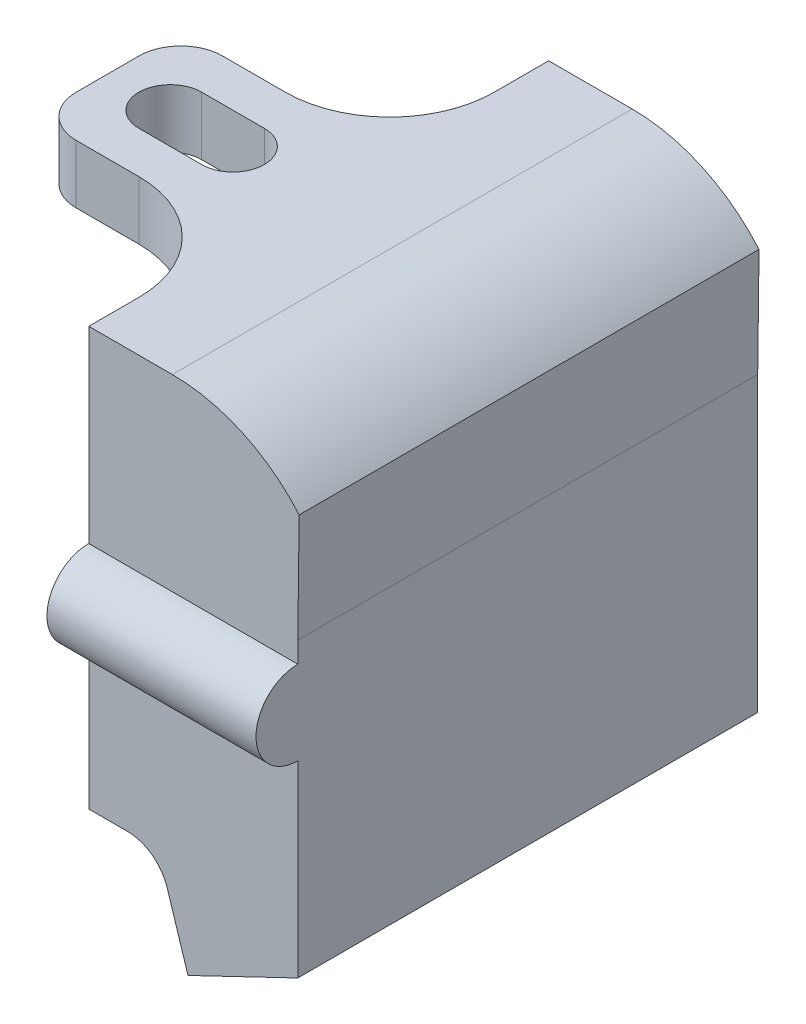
ISO-10303-21;
HEADER;
FILE_DESCRIPTION(('STEP AP214'),'2;1');
FILE_NAME('part.step','',(''),(''),'','','');
FILE_SCHEMA(('AUTOMOTIVE_DESIGN { 1 0 10303 214 1 1 1 1 }'));
ENDSEC;
DATA;
#1=APPLICATION_CONTEXT('core data for automotive mechanical design processes');
#2=APPLICATION_PROTOCOL_DEFINITION('international standard','automotive_design',2000,#1);
#3=PRODUCT_CONTEXT('',#1,'mechanical');
#4=PRODUCT('Part','Part','',(#3));
#5=PRODUCT_RELATED_PRODUCT_CATEGORY('part','',(#4));
#6=PRODUCT_DEFINITION_FORMATION('','',#4);
#7=PRODUCT_DEFINITION_CONTEXT('part definition',#1,'design');
#8=PRODUCT_DEFINITION('design','',#6,#7);
#9=PRODUCT_DEFINITION_SHAPE('','',#8);
#10=(LENGTH_UNIT() NAMED_UNIT(*) SI_UNIT(.MILLI.,.METRE.));
#11=(NAMED_UNIT(*) PLANE_ANGLE_UNIT() SI_UNIT($,.RADIAN.));
#12=(NAMED_UNIT(*) SI_UNIT($,.STERADIAN.) SOLID_ANGLE_UNIT());
#13=UNCERTAINTY_MEASURE_WITH_UNIT(LENGTH_MEASURE(1.E-05),#10,'distance_accuracy_value','');
#14=(GEOMETRIC_REPRESENTATION_CONTEXT(3) GLOBAL_UNCERTAINTY_ASSIGNED_CONTEXT((#13)) GLOBAL_UNIT_ASSIGNED_CONTEXT((#10,
#11,#12)) REPRESENTATION_CONTEXT('',''));
#15=CARTESIAN_POINT('',(0.,0.,0.));
#16=DIRECTION('',(0.,0.,1.));
#17=DIRECTION('',(1.,0.,0.));
#18=AXIS2_PLACEMENT_3D('',#15,#16,#17);
#19=CARTESIAN_POINT('',(31.8319433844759,9.00287861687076,1.));
#20=DIRECTION('',(0.,1.,0.));
#21=DIRECTION('',(-1.,0.,0.));
#22=AXIS2_PLACEMENT_3D('',#19,#20,#21);
#23=PLANE('',#22);
#24=DIRECTION('',(0.,0.,1.));
#25=VECTOR('',#24,1.);
#26=CARTESIAN_POINT('',(19.9412185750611,9.00287861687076,1.));
#27=LINE('',#26,#25);
#28=CARTESIAN_POINT('',(19.9412185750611,9.00287861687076,0.2));
#29=VERTEX_POINT('',#28);
#30=CARTESIAN_POINT('',(19.9412185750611,9.00287861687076,1.));
#31=VERTEX_POINT('',#30);
#32=EDGE_CURVE('E302',#29,#31,#27,.T.);
#33=ORIENTED_EDGE('',*,*,#32,.F.);
#34=DIRECTION('',(1.,0.,0.));
#35=VECTOR('',#34,1.);
#36=CARTESIAN_POINT('',(0.,9.00287861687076,0.2));
#37=LINE('',#36,#35);
#38=CARTESIAN_POINT('',(29.1412185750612,9.00287861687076,0.2));
#39=VERTEX_POINT('',#38);
#40=EDGE_CURVE('E260',#29,#39,#37,.T.);
#41=ORIENTED_EDGE('',*,*,#40,.T.);
#42=DIRECTION('',(0.,0.,1.));
#43=VECTOR('',#42,1.);
#44=CARTESIAN_POINT('',(29.1412185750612,9.00287861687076,1.));
#45=LINE('',#44,#43);
#46=CARTESIAN_POINT('',(29.1412185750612,9.00287861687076,1.));
#47=VERTEX_POINT('',#46);
#48=EDGE_CURVE('E264',#47,#39,#45,.F.);
#49=ORIENTED_EDGE('',*,*,#48,.F.);
#50=DIRECTION('',(-1.,0.,0.));
#51=VECTOR('',#50,1.);
#52=CARTESIAN_POINT('',(31.8319433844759,9.00287861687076,1.));
#53=LINE('',#52,#51);
#54=EDGE_CURVE('E276',#47,#31,#53,.T.);
#55=ORIENTED_EDGE('',*,*,#54,.T.);
#56=EDGE_LOOP('',(#33,#41,#49,#55));
#57=FACE_BOUND('',#56,.T.);
#58=ADVANCED_FACE('F17',(#57),#23,.F.);
#59=CARTESIAN_POINT('',(21.7887571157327,-2.99712138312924,-46.6422255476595));
#60=DIRECTION('',(0.,0.,-1.));
#61=DIRECTION('',(-1.,0.,0.));
#62=AXIS2_PLACEMENT_3D('',#59,#60,#61);
#63=CYLINDRICAL_SURFACE('',#62,2.8);
#64=CARTESIAN_POINT('',(21.7887571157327,-2.99712138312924,0.199999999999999));
#65=DIRECTION('',(0.,0.,-1.));
#66=DIRECTION('',(-1.,0.,0.));
#67=AXIS2_PLACEMENT_3D('',#64,#65,#66);
#68=CIRCLE('',#67,2.8);
#69=CARTESIAN_POINT('',(21.7887571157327,-0.19712138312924,0.199999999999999));
#70=VERTEX_POINT('',#69);
#71=CARTESIAN_POINT('',(24.4576759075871,-2.15043815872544,0.200000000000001));
#72=VERTEX_POINT('',#71);
#73=EDGE_CURVE('E414',#70,#72,#68,.T.);
#74=ORIENTED_EDGE('',*,*,#73,.T.);
#75=DIRECTION('',(0.,0.,1.));
#76=VECTOR('',#75,1.);
#77=CARTESIAN_POINT('',(24.4576759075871,-2.15043815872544,-46.6422255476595));
#78=LINE('',#77,#76);
#79=CARTESIAN_POINT('',(24.4576759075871,-2.15043815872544,-20.1999889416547));
#80=VERTEX_POINT('',#79);
#81=EDGE_CURVE('E310',#72,#80,#78,.F.);
#82=ORIENTED_EDGE('',*,*,#81,.T.);
#83=CARTESIAN_POINT('',(21.7887571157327,-2.99712138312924,-20.1999889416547));
#84=DIRECTION('',(0.,0.,-1.));
#85=DIRECTION('',(-1.,0.,0.));
#86=AXIS2_PLACEMENT_3D('',#83,#84,#85);
#87=CIRCLE('',#86,2.8);
#88=CARTESIAN_POINT('',(21.7887571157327,-0.19712138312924,-20.1999889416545));
#89=VERTEX_POINT('',#88);
#90=EDGE_CURVE('E419',#80,#89,#87,.F.);
#91=ORIENTED_EDGE('',*,*,#90,.T.);
#92=DIRECTION('',(0.,0.,-1.));
#93=VECTOR('',#92,1.);
#94=CARTESIAN_POINT('',(21.7887571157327,-0.19712138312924,-46.6422255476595));
#95=LINE('',#94,#93);
#96=EDGE_CURVE('E321',#89,#70,#95,.F.);
#97=ORIENTED_EDGE('',*,*,#96,.T.);
#98=EDGE_LOOP('',(#74,#82,#91,#97));
#99=FACE_BOUND('',#98,.T.);
#100=ADVANCED_FACE('F956',(#99),#63,.T.);
#101=CARTESIAN_POINT('',(31.8319433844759,7.00287861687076,1.));
#102=DIRECTION('',(0.,-1.,0.));
#103=DIRECTION('',(1.,0.,0.));
#104=AXIS2_PLACEMENT_3D('',#101,#102,#103);
#105=PLANE('',#104);
#106=DIRECTION('',(0.,0.,1.));
#107=VECTOR('',#106,1.);
#108=CARTESIAN_POINT('',(19.9412185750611,7.00287861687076,1.));
#109=LINE('',#108,#107);
#110=CARTESIAN_POINT('',(19.9412185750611,7.00287861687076,1.));
#111=VERTEX_POINT('',#110);
#112=CARTESIAN_POINT('',(19.9412185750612,7.00287861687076,0.2));
#113=VERTEX_POINT('',#112);
#114=EDGE_CURVE('E261',#111,#113,#109,.F.);
#115=ORIENTED_EDGE('',*,*,#114,.F.);
#116=DIRECTION('',(-1.,0.,0.));
#117=VECTOR('',#116,1.);
#118=CARTESIAN_POINT('',(31.8319433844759,7.00287861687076,1.));
#119=LINE('',#118,#117);
#120=CARTESIAN_POINT('',(29.1412185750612,7.00287861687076,1.));
#121=VERTEX_POINT('',#120);
#122=EDGE_CURVE('E323',#111,#121,#119,.F.);
#123=ORIENTED_EDGE('',*,*,#122,.T.);
#124=DIRECTION('',(0.,0.,1.));
#125=VECTOR('',#124,1.);
#126=CARTESIAN_POINT('',(29.1412185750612,7.00287861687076,1.));
#127=LINE('',#126,#125);
#128=CARTESIAN_POINT('',(29.1412185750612,7.00287861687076,0.199999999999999));
#129=VERTEX_POINT('',#128);
#130=EDGE_CURVE('E298',#129,#121,#127,.T.);
#131=ORIENTED_EDGE('',*,*,#130,.F.);
#132=DIRECTION('',(1.,0.,0.));
#133=VECTOR('',#132,1.);
#134=CARTESIAN_POINT('',(0.,7.00287861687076,0.2));
#135=LINE('',#134,#133);
#136=EDGE_CURVE('E280',#129,#113,#135,.F.);
#137=ORIENTED_EDGE('',*,*,#136,.T.);
#138=EDGE_LOOP('',(#115,#123,#131,#137));
#139=FACE_BOUND('',#138,.T.);
#140=ADVANCED_FACE('F496',(#139),#105,.F.);
#141=CARTESIAN_POINT('',(23.1412185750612,10.2028786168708,-46.6422255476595));
#142=DIRECTION('',(0.,0.,-1.));
#143=DIRECTION('',(-1.,0.,0.));
#144=AXIS2_PLACEMENT_3D('',#141,#142,#143);
#145=CYLINDRICAL_SURFACE('',#144,6.);
#146=DIRECTION('',(0.,0.,-1.));
#147=VECTOR('',#146,1.);
#148=CARTESIAN_POINT('',(29.1412185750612,10.2028786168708,-46.6422255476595));
#149=LINE('',#148,#147);
#150=CARTESIAN_POINT('',(29.1412185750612,10.2028786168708,-20.1999889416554));
#151=VERTEX_POINT('',#150);
#152=CARTESIAN_POINT('',(29.1412185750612,10.2028786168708,0.199999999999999));
#153=VERTEX_POINT('',#152);
#154=EDGE_CURVE('E240',#151,#153,#149,.F.);
#155=ORIENTED_EDGE('',*,*,#154,.T.);
#156=CARTESIAN_POINT('',(23.1412185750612,10.2028786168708,0.199999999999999));
#157=DIRECTION('',(0.,0.,-1.));
#158=DIRECTION('',(-1.,0.,0.));
#159=AXIS2_PLACEMENT_3D('',#156,#157,#158);
#160=CIRCLE('',#159,6.);
#161=CARTESIAN_POINT('',(23.1412185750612,16.2028786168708,0.199999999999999));
#162=VERTEX_POINT('',#161);
#163=EDGE_CURVE('E20',#153,#162,#160,.F.);
#164=ORIENTED_EDGE('',*,*,#163,.T.);
#165=DIRECTION('',(0.,0.,1.));
#166=VECTOR('',#165,1.);
#167=CARTESIAN_POINT('',(23.1412185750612,16.2028786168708,-46.6422255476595));
#168=LINE('',#167,#166);
#169=CARTESIAN_POINT('',(23.1412185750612,16.2028786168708,-20.199988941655));
#170=VERTEX_POINT('',#169);
#171=EDGE_CURVE('E328',#162,#170,#168,.F.);
#172=ORIENTED_EDGE('',*,*,#171,.T.);
#173=CARTESIAN_POINT('',(23.1412185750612,10.2028786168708,-20.1999889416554));
#174=DIRECTION('',(0.,0.,-1.));
#175=DIRECTION('',(-1.,0.,0.));
#176=AXIS2_PLACEMENT_3D('',#173,#174,#175);
#177=CIRCLE('',#176,6.);
#178=EDGE_CURVE('E245',#170,#151,#177,.T.);
#179=ORIENTED_EDGE('',*,*,#178,.T.);
#180=EDGE_LOOP('',(#155,#164,#172,#179));
#181=FACE_BOUND('',#180,.T.);
#182=ADVANCED_FACE('F242',(#181),#145,.F.);
#183=CARTESIAN_POINT('',(0.,0.,0.2));
#184=DIRECTION('',(0.,0.,1.));
#185=DIRECTION('',(1.,0.,0.));
#186=AXIS2_PLACEMENT_3D('',#183,#184,#185);
#187=PLANE('',#186);
#188=ORIENTED_EDGE('',*,*,#40,.F.);
#189=DIRECTION('',(0.,-1.,0.));
#190=VECTOR('',#189,1.);
#191=CARTESIAN_POINT('',(19.9412185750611,17.0028786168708,0.199999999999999));
#192=LINE('',#191,#190);
#193=CARTESIAN_POINT('',(19.9412185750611,16.2028786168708,0.199999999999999));
#194=VERTEX_POINT('',#193);
#195=EDGE_CURVE('E412',#194,#29,#192,.T.);
#196=ORIENTED_EDGE('',*,*,#195,.F.);
#197=DIRECTION('',(-1.,0.,0.));
#198=VECTOR('',#197,1.);
#199=CARTESIAN_POINT('',(29.9412185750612,16.2028786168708,0.199999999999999));
#200=LINE('',#199,#198);
#201=EDGE_CURVE('E258',#194,#162,#200,.F.);
#202=ORIENTED_EDGE('',*,*,#201,.T.);
#203=ORIENTED_EDGE('',*,*,#163,.F.);
#204=DIRECTION('',(0.,1.,0.));
#205=VECTOR('',#204,1.);
#206=CARTESIAN_POINT('',(29.1412185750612,-2.99712138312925,0.199999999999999));
#207=LINE('',#206,#205);
#208=EDGE_CURVE('E250',#153,#39,#207,.F.);
#209=ORIENTED_EDGE('',*,*,#208,.T.);
#210=EDGE_LOOP('',(#188,#196,#202,#203,#209));
#211=FACE_BOUND('',#210,.T.);
#212=ADVANCED_FACE('F256',(#211),#187,.F.);
#213=CARTESIAN_POINT('',(31.8319433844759,8.00287861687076,1.));
#214=DIRECTION('',(-1.,0.,0.));
#215=DIRECTION('',(0.,-1.,0.));
#216=AXIS2_PLACEMENT_3D('',#213,#214,#215);
#217=CYLINDRICAL_SURFACE('',#216,1.);
#218=CARTESIAN_POINT('',(19.9412185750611,8.00287861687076,1.));
#219=DIRECTION('',(-1.,0.,0.));
#220=DIRECTION('',(0.,-1.,0.));
#221=AXIS2_PLACEMENT_3D('',#218,#219,#220);
#222=CIRCLE('',#221,1.);
#223=EDGE_CURVE('E409',#31,#111,#222,.F.);
#224=ORIENTED_EDGE('',*,*,#223,.F.);
#225=ORIENTED_EDGE('',*,*,#54,.F.);
#226=CARTESIAN_POINT('',(29.1412185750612,8.00287861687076,1.));
#227=DIRECTION('',(-1.,0.,0.));
#228=DIRECTION('',(0.,-1.,0.));
#229=AXIS2_PLACEMENT_3D('',#226,#227,#228);
#230=CIRCLE('',#229,1.);
#231=EDGE_CURVE('E266',#47,#121,#230,.F.);
#232=ORIENTED_EDGE('',*,*,#231,.T.);
#233=ORIENTED_EDGE('',*,*,#122,.F.);
#234=EDGE_LOOP('',(#224,#225,#232,#233));
#235=FACE_BOUND('',#234,.T.);
#236=ADVANCED_FACE('F492',(#235),#217,.F.);
#237=CARTESIAN_POINT('',(19.9412185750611,-0.19712138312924,-46.6422255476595));
#238=DIRECTION('',(0.,-1.,0.));
#239=DIRECTION('',(0.,0.,-1.));
#240=AXIS2_PLACEMENT_3D('',#237,#238,#239);
#241=PLANE('',#240);
#242=DIRECTION('',(0.,0.,1.));
#243=VECTOR('',#242,1.);
#244=CARTESIAN_POINT('',(19.9412185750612,-0.197121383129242,-46.6422255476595));
#245=LINE('',#244,#243);
#246=CARTESIAN_POINT('',(19.9412185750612,-0.197121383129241,0.199999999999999));
#247=VERTEX_POINT('',#246);
#248=CARTESIAN_POINT('',(19.9412185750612,-0.197121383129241,-20.1999889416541));
#249=VERTEX_POINT('',#248);
#250=EDGE_CURVE('E453',#247,#249,#245,.F.);
#251=ORIENTED_EDGE('',*,*,#250,.F.);
#252=DIRECTION('',(1.,0.,0.));
#253=VECTOR('',#252,1.);
#254=CARTESIAN_POINT('',(0.,-0.19712138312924,0.2));
#255=LINE('',#254,#253);
#256=EDGE_CURVE('E325',#247,#70,#255,.T.);
#257=ORIENTED_EDGE('',*,*,#256,.T.);
#258=ORIENTED_EDGE('',*,*,#96,.F.);
#259=DIRECTION('',(-1.,0.,1.4611402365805E-13));
#260=VECTOR('',#259,1.);
#261=CARTESIAN_POINT('',(22.3853694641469,-0.19712138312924,-20.1999889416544));
#262=LINE('',#261,#260);
#263=EDGE_CURVE('E421',#89,#249,#262,.T.);
#264=ORIENTED_EDGE('',*,*,#263,.T.);
#265=EDGE_LOOP('',(#251,#257,#258,#264));
#266=FACE_BOUND('',#265,.T.);
#267=ADVANCED_FACE('F507',(#266),#241,.F.);
#268=CARTESIAN_POINT('',(29.9412185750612,16.2028786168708,-46.6422255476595));
#269=DIRECTION('',(0.,1.,0.));
#270=DIRECTION('',(-1.,0.,0.));
#271=AXIS2_PLACEMENT_3D('',#268,#269,#270);
#272=PLANE('',#271);
#273=CARTESIAN_POINT('',(11.9412185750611,16.2028786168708,-8.39998894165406));
#274=DIRECTION('',(0.,-1.,0.));
#275=DIRECTION('',(0.,0.,-1.));
#276=AXIS2_PLACEMENT_3D('',#273,#274,#275);
#277=CIRCLE('',#276,2.);
#278=CARTESIAN_POINT('',(9.94121857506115,16.2028786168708,-8.39998894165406));
#279=VERTEX_POINT('',#278);
#280=CARTESIAN_POINT('',(11.9412185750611,16.2028786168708,-6.39998894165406));
#281=VERTEX_POINT('',#280);
#282=EDGE_CURVE('E341',#279,#281,#277,.F.);
#283=ORIENTED_EDGE('',*,*,#282,.F.);
#284=DIRECTION('',(0.,0.,1.));
#285=VECTOR('',#284,1.);
#286=CARTESIAN_POINT('',(9.94121857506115,16.2028786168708,0.));
#287=LINE('',#286,#285);
#288=CARTESIAN_POINT('',(9.94121857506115,16.2028786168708,-11.3999889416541));
#289=VERTEX_POINT('',#288);
#290=EDGE_CURVE('E330',#289,#279,#287,.T.);
#291=ORIENTED_EDGE('',*,*,#290,.F.);
#292=CARTESIAN_POINT('',(11.9412185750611,16.2028786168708,-11.3999889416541));
#293=DIRECTION('',(0.,1.,0.));
#294=DIRECTION('',(0.,0.,1.));
#295=AXIS2_PLACEMENT_3D('',#292,#293,#294);
#296=CIRCLE('',#295,2.);
#297=CARTESIAN_POINT('',(11.9412185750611,16.2028786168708,-13.3999889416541));
#298=VERTEX_POINT('',#297);
#299=EDGE_CURVE('E427',#298,#289,#296,.T.);
#300=ORIENTED_EDGE('',*,*,#299,.F.);
#301=DIRECTION('',(1.,0.,0.));
#302=VECTOR('',#301,1.);
#303=CARTESIAN_POINT('',(9.94121857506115,16.2028786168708,-13.3999889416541));
#304=LINE('',#303,#302);
#305=CARTESIAN_POINT('',(14.9412185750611,16.2028786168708,-13.3999889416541));
#306=VERTEX_POINT('',#305);
#307=EDGE_CURVE('E342',#298,#306,#304,.T.);
#308=ORIENTED_EDGE('',*,*,#307,.T.);
#309=CARTESIAN_POINT('',(14.9412185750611,16.2028786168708,-18.3999889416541));
#310=DIRECTION('',(0.,-1.,0.));
#311=DIRECTION('',(1.,0.,0.));
#312=AXIS2_PLACEMENT_3D('',#309,#310,#311);
#313=CIRCLE('',#312,5.);
#314=CARTESIAN_POINT('',(19.9412185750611,16.2028786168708,-18.3999889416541));
#315=VERTEX_POINT('',#314);
#316=EDGE_CURVE('E430',#306,#315,#313,.F.);
#317=ORIENTED_EDGE('',*,*,#316,.T.);
#318=DIRECTION('',(0.,0.,1.));
#319=VECTOR('',#318,1.);
#320=CARTESIAN_POINT('',(19.9412185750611,16.2028786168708,-46.6422255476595));
#321=LINE('',#320,#319);
#322=CARTESIAN_POINT('',(19.9412185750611,16.2028786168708,-20.1999889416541));
#323=VERTEX_POINT('',#322);
#324=EDGE_CURVE('E444',#323,#315,#321,.T.);
#325=ORIENTED_EDGE('',*,*,#324,.F.);
#326=DIRECTION('',(-1.,0.,1.4611402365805E-13));
#327=VECTOR('',#326,1.);
#328=CARTESIAN_POINT('',(22.3853694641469,16.2028786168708,-20.1999889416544));
#329=LINE('',#328,#327);
#330=EDGE_CURVE('E418',#323,#170,#329,.F.);
#331=ORIENTED_EDGE('',*,*,#330,.T.);
#332=ORIENTED_EDGE('',*,*,#171,.F.);
#333=ORIENTED_EDGE('',*,*,#201,.F.);
#334=DIRECTION('',(0.,0.,1.));
#335=VECTOR('',#334,1.);
#336=CARTESIAN_POINT('',(19.9412185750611,16.2028786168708,-46.6422255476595));
#337=LINE('',#336,#335);
#338=CARTESIAN_POINT('',(19.9412185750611,16.2028786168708,-1.39998894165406));
#339=VERTEX_POINT('',#338);
#340=EDGE_CURVE('E472',#339,#194,#337,.T.);
#341=ORIENTED_EDGE('',*,*,#340,.F.);
#342=CARTESIAN_POINT('',(14.9412185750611,16.2028786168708,-1.39998894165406));
#343=DIRECTION('',(0.,1.,0.));
#344=DIRECTION('',(0.,0.,1.));
#345=AXIS2_PLACEMENT_3D('',#342,#343,#344);
#346=CIRCLE('',#345,5.);
#347=CARTESIAN_POINT('',(14.9412185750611,16.2028786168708,-6.39998894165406));
#348=VERTEX_POINT('',#347);
#349=EDGE_CURVE('E432',#339,#348,#346,.T.);
#350=ORIENTED_EDGE('',*,*,#349,.T.);
#351=DIRECTION('',(1.,0.,0.));
#352=VECTOR('',#351,1.);
#353=CARTESIAN_POINT('',(9.94121857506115,16.2028786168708,-6.39998894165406));
#354=LINE('',#353,#352);
#355=EDGE_CURVE('E347',#348,#281,#354,.F.);
#356=ORIENTED_EDGE('',*,*,#355,.T.);
#357=EDGE_LOOP('',(#283,#291,#300,#308,#317,#325,#331,#332,#333,#341,#350,#356));
#358=FACE_BOUND('',#357,.T.);
#359=CARTESIAN_POINT('',(12.9412185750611,16.2028786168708,-9.89998894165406));
#360=DIRECTION('',(0.,1.,0.));
#361=DIRECTION('',(-1.,0.,0.));
#362=AXIS2_PLACEMENT_3D('',#359,#360,#361);
#363=CIRCLE('',#362,1.5);
#364=CARTESIAN_POINT('',(12.9412185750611,16.2028786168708,-11.3999889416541));
#365=VERTEX_POINT('',#364);
#366=CARTESIAN_POINT('',(12.9412185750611,16.2028786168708,-8.39998894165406));
#367=VERTEX_POINT('',#366);
#368=EDGE_CURVE('E334',#365,#367,#363,.T.);
#369=ORIENTED_EDGE('',*,*,#368,.T.);
#370=DIRECTION('',(1.,0.,0.));
#371=VECTOR('',#370,1.);
#372=CARTESIAN_POINT('',(12.9412185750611,16.2028786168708,-8.39998894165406));
#373=LINE('',#372,#371);
#374=CARTESIAN_POINT('',(15.9412185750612,16.2028786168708,-8.39998894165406));
#375=VERTEX_POINT('',#374);
#376=EDGE_CURVE('E335',#367,#375,#373,.T.);
#377=ORIENTED_EDGE('',*,*,#376,.T.);
#378=CARTESIAN_POINT('',(15.9412185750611,16.2028786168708,-9.89998894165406));
#379=DIRECTION('',(0.,1.,0.));
#380=DIRECTION('',(-1.,0.,0.));
#381=AXIS2_PLACEMENT_3D('',#378,#379,#380);
#382=CIRCLE('',#381,1.5);
#383=CARTESIAN_POINT('',(15.9412185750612,16.2028786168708,-11.3999889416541));
#384=VERTEX_POINT('',#383);
#385=EDGE_CURVE('E338',#375,#384,#382,.T.);
#386=ORIENTED_EDGE('',*,*,#385,.T.);
#387=DIRECTION('',(-1.,0.,0.));
#388=VECTOR('',#387,1.);
#389=CARTESIAN_POINT('',(12.9412185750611,16.2028786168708,-11.3999889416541));
#390=LINE('',#389,#388);
#391=EDGE_CURVE('E331',#384,#365,#390,.T.);
#392=ORIENTED_EDGE('',*,*,#391,.T.);
#393=EDGE_LOOP('',(#369,#377,#386,#392));
#394=FACE_BOUND('',#393,.T.);
#395=ADVANCED_FACE('F517',(#358,#394),#272,.F.);
#396=CARTESIAN_POINT('',(9.94121857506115,0.,0.));
#397=DIRECTION('',(-1.,0.,0.));
#398=DIRECTION('',(0.,0.,1.));
#399=AXIS2_PLACEMENT_3D('',#396,#397,#398);
#400=PLANE('',#399);
#401=DIRECTION('',(0.,0.,1.));
#402=VECTOR('',#401,1.);
#403=CARTESIAN_POINT('',(9.94121857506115,19.0028786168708,-33.8563701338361));
#404=LINE('',#403,#402);
#405=CARTESIAN_POINT('',(9.94121857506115,19.0028786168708,-11.3999889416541));
#406=VERTEX_POINT('',#405);
#407=CARTESIAN_POINT('',(9.94121857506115,19.0028786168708,-8.39998894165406));
#408=VERTEX_POINT('',#407);
#409=EDGE_CURVE('E408',#406,#408,#404,.T.);
#410=ORIENTED_EDGE('',*,*,#409,.F.);
#411=DIRECTION('',(0.,1.,0.));
#412=VECTOR('',#411,1.);
#413=CARTESIAN_POINT('',(9.94121857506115,0.,-11.3999889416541));
#414=LINE('',#413,#412);
#415=EDGE_CURVE('E426',#289,#406,#414,.T.);
#416=ORIENTED_EDGE('',*,*,#415,.F.);
#417=ORIENTED_EDGE('',*,*,#290,.T.);
#418=DIRECTION('',(0.,-1.,0.));
#419=VECTOR('',#418,1.);
#420=CARTESIAN_POINT('',(9.94121857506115,0.,-8.39998894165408));
#421=LINE('',#420,#419);
#422=EDGE_CURVE('E350',#408,#279,#421,.T.);
#423=ORIENTED_EDGE('',*,*,#422,.F.);
#424=EDGE_LOOP('',(#410,#416,#417,#423));
#425=FACE_BOUND('',#424,.T.);
#426=ADVANCED_FACE('F547',(#425),#400,.T.);
#427=CARTESIAN_POINT('',(11.9412185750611,0.,-8.39998894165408));
#428=DIRECTION('',(0.,-1.,0.));
#429=DIRECTION('',(0.,0.,-1.));
#430=AXIS2_PLACEMENT_3D('',#427,#428,#429);
#431=CYLINDRICAL_SURFACE('',#430,2.);
#432=CARTESIAN_POINT('',(11.9412185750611,19.0028786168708,-8.39998894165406));
#433=DIRECTION('',(0.,-1.,0.));
#434=DIRECTION('',(0.,0.,-1.));
#435=AXIS2_PLACEMENT_3D('',#432,#433,#434);
#436=CIRCLE('',#435,2.);
#437=CARTESIAN_POINT('',(11.9412185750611,19.0028786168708,-6.39998894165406));
#438=VERTEX_POINT('',#437);
#439=EDGE_CURVE('E405',#408,#438,#436,.F.);
#440=ORIENTED_EDGE('',*,*,#439,.F.);
#441=ORIENTED_EDGE('',*,*,#422,.T.);
#442=ORIENTED_EDGE('',*,*,#282,.T.);
#443=DIRECTION('',(0.,1.,0.));
#444=VECTOR('',#443,1.);
#445=CARTESIAN_POINT('',(11.9412185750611,16.2028786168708,-6.39998894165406));
#446=LINE('',#445,#444);
#447=EDGE_CURVE('E349',#281,#438,#446,.T.);
#448=ORIENTED_EDGE('',*,*,#447,.T.);
#449=EDGE_LOOP('',(#440,#441,#442,#448));
#450=FACE_BOUND('',#449,.T.);
#451=ADVANCED_FACE('F536',(#450),#431,.T.);
#452=CARTESIAN_POINT('',(9.94121857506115,16.2028786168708,-6.39998894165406));
#453=DIRECTION('',(0.,0.,-1.));
#454=DIRECTION('',(0.,1.,0.));
#455=AXIS2_PLACEMENT_3D('',#452,#453,#454);
#456=PLANE('',#455);
#457=ORIENTED_EDGE('',*,*,#447,.F.);
#458=ORIENTED_EDGE('',*,*,#355,.F.);
#459=DIRECTION('',(0.,1.,0.));
#460=VECTOR('',#459,1.);
#461=CARTESIAN_POINT('',(14.9412185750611,16.2028786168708,-6.39998894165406));
#462=LINE('',#461,#460);
#463=CARTESIAN_POINT('',(14.9412185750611,19.0028786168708,-6.39998894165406));
#464=VERTEX_POINT('',#463);
#465=EDGE_CURVE('E434',#348,#464,#462,.T.);
#466=ORIENTED_EDGE('',*,*,#465,.T.);
#467=DIRECTION('',(1.,0.,0.));
#468=VECTOR('',#467,1.);
#469=CARTESIAN_POINT('',(23.9412185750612,19.0028786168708,-6.39998894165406));
#470=LINE('',#469,#468);
#471=EDGE_CURVE('E404',#438,#464,#470,.T.);
#472=ORIENTED_EDGE('',*,*,#471,.F.);
#473=EDGE_LOOP('',(#457,#458,#466,#472));
#474=FACE_BOUND('',#473,.T.);
#475=ADVANCED_FACE('F538',(#474),#456,.F.);
#476=CARTESIAN_POINT('',(14.9412185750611,16.2028786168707,-1.39998894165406));
#477=DIRECTION('',(0.,1.,0.));
#478=DIRECTION('',(0.,0.,1.));
#479=AXIS2_PLACEMENT_3D('',#476,#477,#478);
#480=CYLINDRICAL_SURFACE('',#479,5.);
#481=DIRECTION('',(0.,-1.,0.));
#482=VECTOR('',#481,1.);
#483=CARTESIAN_POINT('',(19.9412185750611,17.0028786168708,-1.39998894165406));
#484=LINE('',#483,#482);
#485=CARTESIAN_POINT('',(19.9412185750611,19.0028786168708,-1.39998894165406));
#486=VERTEX_POINT('',#485);
#487=EDGE_CURVE('E307',#486,#339,#484,.T.);
#488=ORIENTED_EDGE('',*,*,#487,.F.);
#489=CARTESIAN_POINT('',(14.9412185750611,19.0028786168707,-1.39998894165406));
#490=DIRECTION('',(0.,1.,0.));
#491=DIRECTION('',(0.,0.,1.));
#492=AXIS2_PLACEMENT_3D('',#489,#490,#491);
#493=CIRCLE('',#492,5.);
#494=EDGE_CURVE('E400',#464,#486,#493,.F.);
#495=ORIENTED_EDGE('',*,*,#494,.F.);
#496=ORIENTED_EDGE('',*,*,#465,.F.);
#497=ORIENTED_EDGE('',*,*,#349,.F.);
#498=EDGE_LOOP('',(#488,#495,#496,#497));
#499=FACE_BOUND('',#498,.T.);
#500=ADVANCED_FACE('F558',(#499),#480,.F.);
#501=CARTESIAN_POINT('',(14.9412185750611,16.2028786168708,-18.3999889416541));
#502=DIRECTION('',(0.,-1.,0.));
#503=DIRECTION('',(1.,0.,0.));
#504=AXIS2_PLACEMENT_3D('',#501,#502,#503);
#505=CYLINDRICAL_SURFACE('',#504,5.);
#506=DIRECTION('',(0.,-1.,0.));
#507=VECTOR('',#506,1.);
#508=CARTESIAN_POINT('',(19.9412185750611,17.0028786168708,-18.3999889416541));
#509=LINE('',#508,#507);
#510=CARTESIAN_POINT('',(19.9412185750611,19.0028786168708,-18.3999889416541));
#511=VERTEX_POINT('',#510);
#512=EDGE_CURVE('E447',#315,#511,#509,.F.);
#513=ORIENTED_EDGE('',*,*,#512,.F.);
#514=ORIENTED_EDGE('',*,*,#316,.F.);
#515=DIRECTION('',(0.,1.,0.));
#516=VECTOR('',#515,1.);
#517=CARTESIAN_POINT('',(14.9412185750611,16.2028786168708,-13.3999889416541));
#518=LINE('',#517,#516);
#519=CARTESIAN_POINT('',(14.9412185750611,19.0028786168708,-13.3999889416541));
#520=VERTEX_POINT('',#519);
#521=EDGE_CURVE('E346',#306,#520,#518,.T.);
#522=ORIENTED_EDGE('',*,*,#521,.T.);
#523=CARTESIAN_POINT('',(14.9412185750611,19.0028786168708,-18.3999889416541));
#524=DIRECTION('',(0.,-1.,0.));
#525=DIRECTION('',(1.,0.,0.));
#526=AXIS2_PLACEMENT_3D('',#523,#524,#525);
#527=CIRCLE('',#526,5.);
#528=EDGE_CURVE('E396',#511,#520,#527,.T.);
#529=ORIENTED_EDGE('',*,*,#528,.F.);
#530=EDGE_LOOP('',(#513,#514,#522,#529));
#531=FACE_BOUND('',#530,.T.);
#532=ADVANCED_FACE('F524',(#531),#505,.F.);
#533=CARTESIAN_POINT('',(9.94121857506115,16.2028786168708,-13.3999889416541));
#534=DIRECTION('',(0.,0.,1.));
#535=DIRECTION('',(1.,0.,0.));
#536=AXIS2_PLACEMENT_3D('',#533,#534,#535);
#537=PLANE('',#536);
#538=DIRECTION('',(0.,1.,0.));
#539=VECTOR('',#538,1.);
#540=CARTESIAN_POINT('',(11.9412185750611,0.,-13.3999889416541));
#541=LINE('',#540,#539);
#542=CARTESIAN_POINT('',(11.9412185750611,19.0028786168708,-13.3999889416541));
#543=VERTEX_POINT('',#542);
#544=EDGE_CURVE('E345',#543,#298,#541,.F.);
#545=ORIENTED_EDGE('',*,*,#544,.F.);
#546=DIRECTION('',(1.,0.,0.));
#547=VECTOR('',#546,1.);
#548=CARTESIAN_POINT('',(23.9412185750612,19.0028786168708,-13.3999889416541));
#549=LINE('',#548,#547);
#550=EDGE_CURVE('E395',#520,#543,#549,.F.);
#551=ORIENTED_EDGE('',*,*,#550,.F.);
#552=ORIENTED_EDGE('',*,*,#521,.F.);
#553=ORIENTED_EDGE('',*,*,#307,.F.);
#554=EDGE_LOOP('',(#545,#551,#552,#553));
#555=FACE_BOUND('',#554,.T.);
#556=ADVANCED_FACE('F556',(#555),#537,.F.);
#557=CARTESIAN_POINT('',(11.9412185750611,0.,-11.3999889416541));
#558=DIRECTION('',(0.,1.,0.));
#559=DIRECTION('',(0.,0.,1.));
#560=AXIS2_PLACEMENT_3D('',#557,#558,#559);
#561=CYLINDRICAL_SURFACE('',#560,2.);
#562=ORIENTED_EDGE('',*,*,#299,.T.);
#563=ORIENTED_EDGE('',*,*,#415,.T.);
#564=CARTESIAN_POINT('',(11.9412185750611,19.0028786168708,-11.3999889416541));
#565=DIRECTION('',(0.,1.,0.));
#566=DIRECTION('',(0.,0.,1.));
#567=AXIS2_PLACEMENT_3D('',#564,#565,#566);
#568=CIRCLE('',#567,2.);
#569=EDGE_CURVE('E392',#543,#406,#568,.T.);
#570=ORIENTED_EDGE('',*,*,#569,.F.);
#571=ORIENTED_EDGE('',*,*,#544,.T.);
#572=EDGE_LOOP('',(#562,#563,#570,#571));
#573=FACE_BOUND('',#572,.T.);
#574=ADVANCED_FACE('F549',(#573),#561,.T.);
#575=CARTESIAN_POINT('',(15.9412185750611,7.00287861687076,-9.89998894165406));
#576=DIRECTION('',(0.,1.,0.));
#577=DIRECTION('',(-1.,0.,0.));
#578=AXIS2_PLACEMENT_3D('',#575,#576,#577);
#579=CYLINDRICAL_SURFACE('',#578,1.5);
#580=CARTESIAN_POINT('',(15.9412185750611,19.0028786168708,-9.89998894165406));
#581=DIRECTION('',(0.,1.,0.));
#582=DIRECTION('',(-1.,0.,0.));
#583=AXIS2_PLACEMENT_3D('',#580,#581,#582);
#584=CIRCLE('',#583,1.5);
#585=CARTESIAN_POINT('',(15.9412185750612,19.0028786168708,-11.3999889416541));
#586=VERTEX_POINT('',#585);
#587=CARTESIAN_POINT('',(15.9412185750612,19.0028786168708,-8.39998894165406));
#588=VERTEX_POINT('',#587);
#589=EDGE_CURVE('E389',#586,#588,#584,.F.);
#590=ORIENTED_EDGE('',*,*,#589,.F.);
#591=DIRECTION('',(0.,1.,0.));
#592=VECTOR('',#591,1.);
#593=CARTESIAN_POINT('',(15.9412185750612,7.00287861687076,-11.3999889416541));
#594=LINE('',#593,#592);
#595=EDGE_CURVE('E422',#586,#384,#594,.F.);
#596=ORIENTED_EDGE('',*,*,#595,.T.);
#597=ORIENTED_EDGE('',*,*,#385,.F.);
#598=DIRECTION('',(0.,1.,0.));
#599=VECTOR('',#598,1.);
#600=CARTESIAN_POINT('',(15.9412185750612,7.00287861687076,-8.39998894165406));
#601=LINE('',#600,#599);
#602=EDGE_CURVE('E337',#375,#588,#601,.T.);
#603=ORIENTED_EDGE('',*,*,#602,.T.);
#604=EDGE_LOOP('',(#590,#596,#597,#603));
#605=FACE_BOUND('',#604,.T.);
#606=ADVANCED_FACE('F659',(#605),#579,.F.);
#607=CARTESIAN_POINT('',(12.9412185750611,7.00287861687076,-8.39998894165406));
#608=DIRECTION('',(0.,0.,1.));
#609=DIRECTION('',(1.,0.,0.));
#610=AXIS2_PLACEMENT_3D('',#607,#608,#609);
#611=PLANE('',#610);
#612=DIRECTION('',(1.,0.,0.));
#613=VECTOR('',#612,1.);
#614=CARTESIAN_POINT('',(23.9412185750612,19.0028786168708,-8.39998894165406));
#615=LINE('',#614,#613);
#616=CARTESIAN_POINT('',(12.9412185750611,19.0028786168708,-8.39998894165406));
#617=VERTEX_POINT('',#616);
#618=EDGE_CURVE('E388',#588,#617,#615,.F.);
#619=ORIENTED_EDGE('',*,*,#618,.F.);
#620=ORIENTED_EDGE('',*,*,#602,.F.);
#621=ORIENTED_EDGE('',*,*,#376,.F.);
#622=DIRECTION('',(0.,1.,0.));
#623=VECTOR('',#622,1.);
#624=CARTESIAN_POINT('',(12.9412185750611,7.00287861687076,-8.39998894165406));
#625=LINE('',#624,#623);
#626=EDGE_CURVE('E424',#367,#617,#625,.T.);
#627=ORIENTED_EDGE('',*,*,#626,.T.);
#628=EDGE_LOOP('',(#619,#620,#621,#627));
#629=FACE_BOUND('',#628,.T.);
#630=ADVANCED_FACE('F661',(#629),#611,.F.);
#631=CARTESIAN_POINT('',(12.9412185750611,7.00287861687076,-9.89998894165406));
#632=DIRECTION('',(0.,1.,0.));
#633=DIRECTION('',(-1.,0.,0.));
#634=AXIS2_PLACEMENT_3D('',#631,#632,#633);
#635=CYLINDRICAL_SURFACE('',#634,1.5);
#636=ORIENTED_EDGE('',*,*,#368,.F.);
#637=DIRECTION('',(0.,1.,0.));
#638=VECTOR('',#637,1.);
#639=CARTESIAN_POINT('',(12.9412185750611,7.00287861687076,-11.3999889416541));
#640=LINE('',#639,#638);
#641=CARTESIAN_POINT('',(12.9412185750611,19.0028786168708,-11.3999889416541));
#642=VERTEX_POINT('',#641);
#643=EDGE_CURVE('E333',#365,#642,#640,.T.);
#644=ORIENTED_EDGE('',*,*,#643,.T.);
#645=CARTESIAN_POINT('',(12.9412185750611,19.0028786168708,-9.89998894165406));
#646=DIRECTION('',(0.,1.,0.));
#647=DIRECTION('',(-1.,0.,0.));
#648=AXIS2_PLACEMENT_3D('',#645,#646,#647);
#649=CIRCLE('',#648,1.5);
#650=EDGE_CURVE('E384',#617,#642,#649,.F.);
#651=ORIENTED_EDGE('',*,*,#650,.F.);
#652=ORIENTED_EDGE('',*,*,#626,.F.);
#653=EDGE_LOOP('',(#636,#644,#651,#652));
#654=FACE_BOUND('',#653,.T.);
#655=ADVANCED_FACE('F670',(#654),#635,.F.);
#656=CARTESIAN_POINT('',(12.9412185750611,7.00287861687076,-11.3999889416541));
#657=DIRECTION('',(0.,0.,-1.));
#658=DIRECTION('',(-1.,0.,0.));
#659=AXIS2_PLACEMENT_3D('',#656,#657,#658);
#660=PLANE('',#659);
#661=DIRECTION('',(1.,0.,0.));
#662=VECTOR('',#661,1.);
#663=CARTESIAN_POINT('',(23.9412185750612,19.0028786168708,-11.3999889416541));
#664=LINE('',#663,#662);
#665=EDGE_CURVE('E387',#642,#586,#664,.T.);
#666=ORIENTED_EDGE('',*,*,#665,.F.);
#667=ORIENTED_EDGE('',*,*,#643,.F.);
#668=ORIENTED_EDGE('',*,*,#391,.F.);
#669=ORIENTED_EDGE('',*,*,#595,.F.);
#670=EDGE_LOOP('',(#666,#667,#668,#669));
#671=FACE_BOUND('',#670,.T.);
#672=ADVANCED_FACE('F666',(#671),#660,.F.);
#673=CARTESIAN_POINT('',(22.3853694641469,8.20287861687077,-20.1999889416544));
#674=DIRECTION('',(-1.4611402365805E-13,0.,-1.));
#675=DIRECTION('',(-1.,0.,1.4611402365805E-13));
#676=AXIS2_PLACEMENT_3D('',#673,#674,#675);
#677=PLANE('',#676);
#678=ORIENTED_EDGE('',*,*,#178,.F.);
#679=ORIENTED_EDGE('',*,*,#330,.F.);
#680=DIRECTION('',(0.,-1.,0.));
#681=VECTOR('',#680,1.);
#682=CARTESIAN_POINT('',(19.9412185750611,17.0028786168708,-20.1999889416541));
#683=LINE('',#682,#681);
#684=EDGE_CURVE('E448',#249,#323,#683,.F.);
#685=ORIENTED_EDGE('',*,*,#684,.F.);
#686=ORIENTED_EDGE('',*,*,#263,.F.);
#687=ORIENTED_EDGE('',*,*,#90,.F.);
#688=DIRECTION('',(0.302386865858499,-0.953185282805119,0.));
#689=VECTOR('',#688,1.);
#690=CARTESIAN_POINT('',(25.4496036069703,-5.27719725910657,-20.1999889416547));
#691=LINE('',#690,#689);
#692=CARTESIAN_POINT('',(25.415433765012,-5.16948692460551,-20.199988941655));
#693=VERTEX_POINT('',#692);
#694=EDGE_CURVE('E312',#80,#693,#691,.T.);
#695=ORIENTED_EDGE('',*,*,#694,.T.);
#696=DIRECTION('',(0.901523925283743,0.432729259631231,0.));
#697=VECTOR('',#696,1.);
#698=CARTESIAN_POINT('',(24.6870553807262,-5.51910675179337,-20.1999889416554));
#699=LINE('',#698,#697);
#700=CARTESIAN_POINT('',(29.1412185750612,-3.38111940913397,-20.1999889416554));
#701=VERTEX_POINT('',#700);
#702=EDGE_CURVE('E283',#701,#693,#699,.F.);
#703=ORIENTED_EDGE('',*,*,#702,.F.);
#704=DIRECTION('',(0.,1.,0.));
#705=VECTOR('',#704,1.);
#706=CARTESIAN_POINT('',(29.1412185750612,-2.99712138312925,-20.1999889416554));
#707=LINE('',#706,#705);
#708=EDGE_CURVE('E251',#701,#151,#707,.T.);
#709=ORIENTED_EDGE('',*,*,#708,.T.);
#710=EDGE_LOOP('',(#678,#679,#685,#686,#687,#695,#703,#709));
#711=FACE_BOUND('',#710,.T.);
#712=ADVANCED_FACE('F512',(#711),#677,.F.);
#713=CARTESIAN_POINT('',(25.4496036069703,-5.27719725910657,-46.6422255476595));
#714=DIRECTION('',(-0.953185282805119,-0.302386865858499,0.));
#715=DIRECTION('',(0.302386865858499,-0.953185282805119,0.));
#716=AXIS2_PLACEMENT_3D('',#713,#714,#715);
#717=PLANE('',#716);
#718=DIRECTION('',(0.,0.,1.));
#719=VECTOR('',#718,1.);
#720=CARTESIAN_POINT('',(25.415433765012,-5.16948692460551,-46.6422255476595));
#721=LINE('',#720,#719);
#722=CARTESIAN_POINT('',(25.415433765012,-5.16948692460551,0.2));
#723=VERTEX_POINT('',#722);
#724=EDGE_CURVE('E286',#693,#723,#721,.T.);
#725=ORIENTED_EDGE('',*,*,#724,.F.);
#726=ORIENTED_EDGE('',*,*,#694,.F.);
#727=ORIENTED_EDGE('',*,*,#81,.F.);
#728=DIRECTION('',(0.3023868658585,-0.953185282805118,0.));
#729=VECTOR('',#728,1.);
#730=CARTESIAN_POINT('',(24.4576759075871,-2.15043815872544,0.2));
#731=LINE('',#730,#729);
#732=EDGE_CURVE('E416',#72,#723,#731,.T.);
#733=ORIENTED_EDGE('',*,*,#732,.T.);
#734=EDGE_LOOP('',(#725,#726,#727,#733));
#735=FACE_BOUND('',#734,.T.);
#736=ADVANCED_FACE('F732',(#735),#717,.F.);
#737=CARTESIAN_POINT('',(0.,0.,0.2));
#738=DIRECTION('',(0.,0.,1.));
#739=DIRECTION('',(1.,0.,0.));
#740=AXIS2_PLACEMENT_3D('',#737,#738,#739);
#741=PLANE('',#740);
#742=ORIENTED_EDGE('',*,*,#136,.F.);
#743=DIRECTION('',(0.,1.,0.));
#744=VECTOR('',#743,1.);
#745=CARTESIAN_POINT('',(29.1412185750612,-2.99712138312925,0.199999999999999));
#746=LINE('',#745,#744);
#747=CARTESIAN_POINT('',(29.1412185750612,-3.38111940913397,0.199999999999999));
#748=VERTEX_POINT('',#747);
#749=EDGE_CURVE('E269',#129,#748,#746,.F.);
#750=ORIENTED_EDGE('',*,*,#749,.T.);
#751=DIRECTION('',(0.901523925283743,0.432729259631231,0.));
#752=VECTOR('',#751,1.);
#753=CARTESIAN_POINT('',(24.6870553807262,-5.51910675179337,0.199999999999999));
#754=LINE('',#753,#752);
#755=EDGE_CURVE('E294',#723,#748,#754,.T.);
#756=ORIENTED_EDGE('',*,*,#755,.F.);
#757=ORIENTED_EDGE('',*,*,#732,.F.);
#758=ORIENTED_EDGE('',*,*,#73,.F.);
#759=ORIENTED_EDGE('',*,*,#256,.F.);
#760=DIRECTION('',(0.,-1.,0.));
#761=VECTOR('',#760,1.);
#762=CARTESIAN_POINT('',(19.9412185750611,17.0028786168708,0.199999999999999));
#763=LINE('',#762,#761);
#764=EDGE_CURVE('E411',#113,#247,#763,.T.);
#765=ORIENTED_EDGE('',*,*,#764,.F.);
#766=EDGE_LOOP('',(#742,#750,#756,#757,#758,#759,#765));
#767=FACE_BOUND('',#766,.T.);
#768=ADVANCED_FACE('F499',(#767),#741,.F.);
#769=CARTESIAN_POINT('',(29.1412185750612,-2.99712138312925,-46.6422255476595));
#770=DIRECTION('',(1.,0.,0.));
#771=DIRECTION('',(0.,0.,-1.));
#772=AXIS2_PLACEMENT_3D('',#769,#770,#771);
#773=PLANE('',#772);
#774=ORIENTED_EDGE('',*,*,#130,.T.);
#775=ORIENTED_EDGE('',*,*,#231,.F.);
#776=ORIENTED_EDGE('',*,*,#48,.T.);
#777=ORIENTED_EDGE('',*,*,#208,.F.);
#778=ORIENTED_EDGE('',*,*,#154,.F.);
#779=ORIENTED_EDGE('',*,*,#708,.F.);
#780=DIRECTION('',(0.,0.,1.));
#781=VECTOR('',#780,1.);
#782=CARTESIAN_POINT('',(29.1412185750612,-3.38111940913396,-46.6422255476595));
#783=LINE('',#782,#781);
#784=EDGE_CURVE('E290',#748,#701,#783,.F.);
#785=ORIENTED_EDGE('',*,*,#784,.F.);
#786=ORIENTED_EDGE('',*,*,#749,.F.);
#787=EDGE_LOOP('',(#774,#775,#776,#777,#778,#779,#785,#786));
#788=FACE_BOUND('',#787,.T.);
#789=ADVANCED_FACE('F262',(#788),#773,.F.);
#790=CARTESIAN_POINT('',(19.9412185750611,17.0028786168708,-46.6422255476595));
#791=DIRECTION('',(-1.,0.,0.));
#792=DIRECTION('',(0.,-1.,0.));
#793=AXIS2_PLACEMENT_3D('',#790,#791,#792);
#794=PLANE('',#793);
#795=CARTESIAN_POINT('',(19.9412185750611,8.00287861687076,1.));
#796=DIRECTION('',(-1.,0.,0.));
#797=DIRECTION('',(0.,-1.,0.));
#798=AXIS2_PLACEMENT_3D('',#795,#796,#797);
#799=CIRCLE('',#798,2.);
#800=CARTESIAN_POINT('',(19.9412185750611,10.0028786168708,1.));
#801=VERTEX_POINT('',#800);
#802=CARTESIAN_POINT('',(19.9412185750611,6.00287861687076,1.));
#803=VERTEX_POINT('',#802);
#804=EDGE_CURVE('E376',#801,#803,#799,.F.);
#805=ORIENTED_EDGE('',*,*,#804,.F.);
#806=DIRECTION('',(0.,1.,0.));
#807=VECTOR('',#806,1.);
#808=CARTESIAN_POINT('',(19.9412185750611,0.,1.));
#809=LINE('',#808,#807);
#810=CARTESIAN_POINT('',(19.9412185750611,19.0028786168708,1.));
#811=VERTEX_POINT('',#810);
#812=EDGE_CURVE('E565',#811,#801,#809,.F.);
#813=ORIENTED_EDGE('',*,*,#812,.F.);
#814=DIRECTION('',(0.,0.,1.));
#815=VECTOR('',#814,1.);
#816=CARTESIAN_POINT('',(19.9412185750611,19.0028786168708,-33.8563701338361));
#817=LINE('',#816,#815);
#818=EDGE_CURVE('E403',#486,#811,#817,.T.);
#819=ORIENTED_EDGE('',*,*,#818,.F.);
#820=ORIENTED_EDGE('',*,*,#487,.T.);
#821=ORIENTED_EDGE('',*,*,#340,.T.);
#822=ORIENTED_EDGE('',*,*,#195,.T.);
#823=ORIENTED_EDGE('',*,*,#32,.T.);
#824=ORIENTED_EDGE('',*,*,#223,.T.);
#825=ORIENTED_EDGE('',*,*,#114,.T.);
#826=ORIENTED_EDGE('',*,*,#764,.T.);
#827=ORIENTED_EDGE('',*,*,#250,.T.);
#828=ORIENTED_EDGE('',*,*,#684,.T.);
#829=ORIENTED_EDGE('',*,*,#324,.T.);
#830=ORIENTED_EDGE('',*,*,#512,.T.);
#831=DIRECTION('',(0.,0.,1.));
#832=VECTOR('',#831,1.);
#833=CARTESIAN_POINT('',(19.9412185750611,19.0028786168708,-33.8563701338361));
#834=LINE('',#833,#832);
#835=CARTESIAN_POINT('',(19.9412185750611,19.0028786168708,-20.9999889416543));
#836=VERTEX_POINT('',#835);
#837=EDGE_CURVE('E399',#836,#511,#834,.T.);
#838=ORIENTED_EDGE('',*,*,#837,.F.);
#839=DIRECTION('',(0.,1.,0.));
#840=VECTOR('',#839,1.);
#841=CARTESIAN_POINT('',(19.9412185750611,8.20287861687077,-20.9999889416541));
#842=LINE('',#841,#840);
#843=CARTESIAN_POINT('',(19.9412185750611,-0.99712138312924,-20.9999889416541));
#844=VERTEX_POINT('',#843);
#845=EDGE_CURVE('E293',#844,#836,#842,.T.);
#846=ORIENTED_EDGE('',*,*,#845,.F.);
#847=DIRECTION('',(0.,0.,-1.));
#848=VECTOR('',#847,1.);
#849=CARTESIAN_POINT('',(19.9412185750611,-0.99712138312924,-46.6422255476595));
#850=LINE('',#849,#848);
#851=CARTESIAN_POINT('',(19.9412185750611,-0.99712138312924,1.));
#852=VERTEX_POINT('',#851);
#853=EDGE_CURVE('E575',#852,#844,#850,.T.);
#854=ORIENTED_EDGE('',*,*,#853,.F.);
#855=DIRECTION('',(0.,1.,0.));
#856=VECTOR('',#855,1.);
#857=CARTESIAN_POINT('',(19.9412185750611,0.,1.));
#858=LINE('',#857,#856);
#859=EDGE_CURVE('E642',#803,#852,#858,.F.);
#860=ORIENTED_EDGE('',*,*,#859,.F.);
#861=EDGE_LOOP('',(#805,#813,#819,#820,#821,#822,#823,#824,#825,#826,#827,#828,#829,#830,#838,
#846,#854,#860));
#862=FACE_BOUND('',#861,.T.);
#863=ADVANCED_FACE('F484',(#862),#794,.T.);
#864=CARTESIAN_POINT('',(23.9412185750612,19.0028786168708,-33.8563701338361));
#865=DIRECTION('',(0.,1.,0.));
#866=DIRECTION('',(0.,0.,1.));
#867=AXIS2_PLACEMENT_3D('',#864,#865,#866);
#868=PLANE('',#867);
#869=ORIENTED_EDGE('',*,*,#650,.T.);
#870=ORIENTED_EDGE('',*,*,#665,.T.);
#871=ORIENTED_EDGE('',*,*,#589,.T.);
#872=ORIENTED_EDGE('',*,*,#618,.T.);
#873=EDGE_LOOP('',(#869,#870,#871,#872));
#874=FACE_BOUND('',#873,.T.);
#875=ORIENTED_EDGE('',*,*,#550,.T.);
#876=ORIENTED_EDGE('',*,*,#569,.T.);
#877=ORIENTED_EDGE('',*,*,#409,.T.);
#878=ORIENTED_EDGE('',*,*,#439,.T.);
#879=ORIENTED_EDGE('',*,*,#471,.T.);
#880=ORIENTED_EDGE('',*,*,#494,.T.);
#881=ORIENTED_EDGE('',*,*,#818,.T.);
#882=DIRECTION('',(1.,0.,0.));
#883=VECTOR('',#882,1.);
#884=CARTESIAN_POINT('',(0.,19.0028786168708,1.));
#885=LINE('',#884,#883);
#886=CARTESIAN_POINT('',(23.9412185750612,19.0028786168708,1.));
#887=VERTEX_POINT('',#886);
#888=EDGE_CURVE('E562',#887,#811,#885,.F.);
#889=ORIENTED_EDGE('',*,*,#888,.F.);
#890=DIRECTION('',(0.,0.,1.));
#891=VECTOR('',#890,1.);
#892=CARTESIAN_POINT('',(23.9412185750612,19.0028786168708,-33.8563701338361));
#893=LINE('',#892,#891);
#894=CARTESIAN_POINT('',(23.9412185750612,19.0028786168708,-20.9999889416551));
#895=VERTEX_POINT('',#894);
#896=EDGE_CURVE('E573',#895,#887,#893,.T.);
#897=ORIENTED_EDGE('',*,*,#896,.F.);
#898=DIRECTION('',(-1.,0.,1.4611402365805E-13));
#899=VECTOR('',#898,1.);
#900=CARTESIAN_POINT('',(22.3853694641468,19.0028786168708,-20.9999889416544));
#901=LINE('',#900,#899);
#902=EDGE_CURVE('E370',#836,#895,#901,.F.);
#903=ORIENTED_EDGE('',*,*,#902,.F.);
#904=ORIENTED_EDGE('',*,*,#837,.T.);
#905=ORIENTED_EDGE('',*,*,#528,.T.);
#906=EDGE_LOOP('',(#875,#876,#877,#878,#879,#880,#881,#889,#897,#903,#904,#905));
#907=FACE_BOUND('',#906,.T.);
#908=ADVANCED_FACE('F542',(#874,#907),#868,.T.);
#909=CARTESIAN_POINT('',(24.6870553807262,-5.51910675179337,-46.6422255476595));
#910=DIRECTION('',(-0.953185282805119,-0.302386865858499,0.));
#911=DIRECTION('',(0.302386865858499,-0.953185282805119,0.));
#912=AXIS2_PLACEMENT_3D('',#909,#910,#911);
#913=PLANE('',#912);
#914=DIRECTION('',(-0.302386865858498,0.953185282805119,0.));
#915=VECTOR('',#914,1.);
#916=CARTESIAN_POINT('',(24.6870553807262,-5.51910675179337,-20.9999889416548));
#917=LINE('',#916,#915);
#918=CARTESIAN_POINT('',(24.6870553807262,-5.51910675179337,-20.9999889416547));
#919=VERTEX_POINT('',#918);
#920=CARTESIAN_POINT('',(23.695127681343,-2.39234765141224,-20.9999889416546));
#921=VERTEX_POINT('',#920);
#922=EDGE_CURVE('E366',#919,#921,#917,.T.);
#923=ORIENTED_EDGE('',*,*,#922,.F.);
#924=DIRECTION('',(0.,0.,1.));
#925=VECTOR('',#924,1.);
#926=CARTESIAN_POINT('',(24.6870553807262,-5.51910675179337,-46.6422255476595));
#927=LINE('',#926,#925);
#928=CARTESIAN_POINT('',(24.6870553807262,-5.51910675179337,1.));
#929=VERTEX_POINT('',#928);
#930=EDGE_CURVE('E618',#929,#919,#927,.F.);
#931=ORIENTED_EDGE('',*,*,#930,.F.);
#932=DIRECTION('',(0.302386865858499,-0.953185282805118,0.));
#933=VECTOR('',#932,1.);
#934=CARTESIAN_POINT('',(23.695127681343,-2.39234765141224,1.));
#935=LINE('',#934,#933);
#936=CARTESIAN_POINT('',(23.695127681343,-2.39234765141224,1.));
#937=VERTEX_POINT('',#936);
#938=EDGE_CURVE('E374',#937,#929,#935,.T.);
#939=ORIENTED_EDGE('',*,*,#938,.F.);
#940=DIRECTION('',(0.,0.,-1.));
#941=VECTOR('',#940,1.);
#942=CARTESIAN_POINT('',(23.695127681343,-2.39234765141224,-46.6422255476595));
#943=LINE('',#942,#941);
#944=EDGE_CURVE('E604',#937,#921,#943,.T.);
#945=ORIENTED_EDGE('',*,*,#944,.T.);
#946=EDGE_LOOP('',(#923,#931,#939,#945));
#947=FACE_BOUND('',#946,.T.);
#948=ADVANCED_FACE('F719',(#947),#913,.T.);
#949=CARTESIAN_POINT('',(21.7887571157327,-2.99712138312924,-46.6422255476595));
#950=DIRECTION('',(0.,0.,-1.));
#951=DIRECTION('',(-1.,0.,0.));
#952=AXIS2_PLACEMENT_3D('',#949,#950,#951);
#953=CYLINDRICAL_SURFACE('',#952,2.);
#954=ORIENTED_EDGE('',*,*,#944,.F.);
#955=CARTESIAN_POINT('',(21.7887571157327,-2.99712138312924,1.));
#956=DIRECTION('',(0.,0.,-1.));
#957=DIRECTION('',(-1.,0.,0.));
#958=AXIS2_PLACEMENT_3D('',#955,#956,#957);
#959=CIRCLE('',#958,2.);
#960=CARTESIAN_POINT('',(21.7887571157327,-0.99712138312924,1.));
#961=VERTEX_POINT('',#960);
#962=EDGE_CURVE('E371',#961,#937,#959,.T.);
#963=ORIENTED_EDGE('',*,*,#962,.F.);
#964=DIRECTION('',(0.,0.,-1.));
#965=VECTOR('',#964,1.);
#966=CARTESIAN_POINT('',(21.7887571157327,-0.99712138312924,-46.6422255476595));
#967=LINE('',#966,#965);
#968=CARTESIAN_POINT('',(21.7887571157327,-0.99712138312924,-20.9999889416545));
#969=VERTEX_POINT('',#968);
#970=EDGE_CURVE('E602',#969,#961,#967,.F.);
#971=ORIENTED_EDGE('',*,*,#970,.F.);
#972=CARTESIAN_POINT('',(21.7887571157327,-2.99712138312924,-20.9999889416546));
#973=DIRECTION('',(0.,0.,-1.));
#974=DIRECTION('',(-1.,0.,0.));
#975=AXIS2_PLACEMENT_3D('',#972,#973,#974);
#976=CIRCLE('',#975,2.);
#977=EDGE_CURVE('E362',#921,#969,#976,.F.);
#978=ORIENTED_EDGE('',*,*,#977,.F.);
#979=EDGE_LOOP('',(#954,#963,#971,#978));
#980=FACE_BOUND('',#979,.T.);
#981=ADVANCED_FACE('F715',(#980),#953,.F.);
#982=CARTESIAN_POINT('',(19.9412185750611,-0.99712138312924,-46.6422255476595));
#983=DIRECTION('',(0.,-1.,0.));
#984=DIRECTION('',(0.,0.,-1.));
#985=AXIS2_PLACEMENT_3D('',#982,#983,#984);
#986=PLANE('',#985);
#987=DIRECTION('',(1.,0.,0.));
#988=VECTOR('',#987,1.);
#989=CARTESIAN_POINT('',(0.,-0.99712138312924,1.));
#990=LINE('',#989,#988);
#991=EDGE_CURVE('E375',#852,#961,#990,.T.);
#992=ORIENTED_EDGE('',*,*,#991,.F.);
#993=ORIENTED_EDGE('',*,*,#853,.T.);
#994=DIRECTION('',(-1.,0.,1.4611402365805E-13));
#995=VECTOR('',#994,1.);
#996=CARTESIAN_POINT('',(22.3853694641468,-0.99712138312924,-20.9999889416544));
#997=LINE('',#996,#995);
#998=EDGE_CURVE('E365',#969,#844,#997,.T.);
#999=ORIENTED_EDGE('',*,*,#998,.F.);
#1000=ORIENTED_EDGE('',*,*,#970,.T.);
#1001=EDGE_LOOP('',(#992,#993,#999,#1000));
#1002=FACE_BOUND('',#1001,.T.);
#1003=ADVANCED_FACE('F711',(#1002),#986,.T.);
#1004=CARTESIAN_POINT('',(23.9412185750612,11.0028786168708,-33.8563701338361));
#1005=DIRECTION('',(0.,0.,1.));
#1006=DIRECTION('',(1.,0.,0.));
#1007=AXIS2_PLACEMENT_3D('',#1004,#1005,#1006);
#1008=CYLINDRICAL_SURFACE('',#1007,8.);
#1009=ORIENTED_EDGE('',*,*,#896,.T.);
#1010=CARTESIAN_POINT('',(23.9412185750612,11.0028786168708,1.));
#1011=DIRECTION('',(0.,0.,1.));
#1012=DIRECTION('',(1.,0.,0.));
#1013=AXIS2_PLACEMENT_3D('',#1010,#1011,#1012);
#1014=CIRCLE('',#1013,8.);
#1015=CARTESIAN_POINT('',(30.0053398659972,16.2207740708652,1.));
#1016=VERTEX_POINT('',#1015);
#1017=EDGE_CURVE('E380',#1016,#887,#1014,.T.);
#1018=ORIENTED_EDGE('',*,*,#1017,.F.);
#1019=DIRECTION('',(0.,0.,1.));
#1020=VECTOR('',#1019,1.);
#1021=CARTESIAN_POINT('',(30.0053398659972,16.2207740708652,-33.8563701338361));
#1022=LINE('',#1021,#1020);
#1023=CARTESIAN_POINT('',(30.0053398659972,16.2207740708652,-20.9999889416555));
#1024=VERTEX_POINT('',#1023);
#1025=EDGE_CURVE('E582',#1024,#1016,#1022,.T.);
#1026=ORIENTED_EDGE('',*,*,#1025,.F.);
#1027=CARTESIAN_POINT('',(23.9412185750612,11.0028786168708,-20.9999889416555));
#1028=DIRECTION('',(0.,0.,1.));
#1029=DIRECTION('',(1.,0.,0.));
#1030=AXIS2_PLACEMENT_3D('',#1027,#1028,#1029);
#1031=CIRCLE('',#1030,8.);
#1032=EDGE_CURVE('E367',#895,#1024,#1031,.F.);
#1033=ORIENTED_EDGE('',*,*,#1032,.F.);
#1034=EDGE_LOOP('',(#1009,#1018,#1026,#1033));
#1035=FACE_BOUND('',#1034,.T.);
#1036=ADVANCED_FACE('F708',(#1035),#1008,.T.);
#1037=CARTESIAN_POINT('',(0.,0.,1.));
#1038=DIRECTION('',(0.,0.,1.));
#1039=DIRECTION('',(1.,0.,0.));
#1040=AXIS2_PLACEMENT_3D('',#1037,#1038,#1039);
#1041=PLANE('',#1040);
#1042=DIRECTION('',(0.0122877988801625,0.999924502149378,0.));
#1043=VECTOR('',#1042,1.);
#1044=CARTESIAN_POINT('',(29.9412185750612,11.0028786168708,1.));
#1045=LINE('',#1044,#1043);
#1046=CARTESIAN_POINT('',(29.9412185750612,11.0028786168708,1.));
#1047=VERTEX_POINT('',#1046);
#1048=EDGE_CURVE('E361',#1016,#1047,#1045,.F.);
#1049=ORIENTED_EDGE('',*,*,#1048,.F.);
#1050=ORIENTED_EDGE('',*,*,#1017,.T.);
#1051=ORIENTED_EDGE('',*,*,#888,.T.);
#1052=ORIENTED_EDGE('',*,*,#812,.T.);
#1053=DIRECTION('',(-1.,0.,0.));
#1054=VECTOR('',#1053,1.);
#1055=CARTESIAN_POINT('',(34.8238408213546,10.0028786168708,1.));
#1056=LINE('',#1055,#1054);
#1057=CARTESIAN_POINT('',(29.9412185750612,10.0028786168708,1.));
#1058=VERTEX_POINT('',#1057);
#1059=EDGE_CURVE('E379',#1058,#801,#1056,.T.);
#1060=ORIENTED_EDGE('',*,*,#1059,.F.);
#1061=DIRECTION('',(0.,1.,0.));
#1062=VECTOR('',#1061,1.);
#1063=CARTESIAN_POINT('',(29.9412185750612,0.,1.));
#1064=LINE('',#1063,#1062);
#1065=EDGE_CURVE('E383',#1058,#1047,#1064,.T.);
#1066=ORIENTED_EDGE('',*,*,#1065,.T.);
#1067=EDGE_LOOP('',(#1049,#1050,#1051,#1052,#1060,#1066));
#1068=FACE_BOUND('',#1067,.T.);
#1069=ADVANCED_FACE('F572',(#1068),#1041,.T.);
#1070=CARTESIAN_POINT('',(34.8238408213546,8.00287861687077,1.));
#1071=DIRECTION('',(-1.,0.,0.));
#1072=DIRECTION('',(0.,-1.,0.));
#1073=AXIS2_PLACEMENT_3D('',#1070,#1071,#1072);
#1074=CYLINDRICAL_SURFACE('',#1073,2.);
#1075=ORIENTED_EDGE('',*,*,#804,.T.);
#1076=DIRECTION('',(1.,0.,0.));
#1077=VECTOR('',#1076,1.);
#1078=CARTESIAN_POINT('',(0.,6.00287861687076,1.));
#1079=LINE('',#1078,#1077);
#1080=CARTESIAN_POINT('',(29.9412185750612,6.00287861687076,1.));
#1081=VERTEX_POINT('',#1080);
#1082=EDGE_CURVE('E378',#1081,#803,#1079,.F.);
#1083=ORIENTED_EDGE('',*,*,#1082,.F.);
#1084=CARTESIAN_POINT('',(29.9412185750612,8.00287861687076,1.));
#1085=DIRECTION('',(-1.,0.,0.));
#1086=DIRECTION('',(0.,-1.,0.));
#1087=AXIS2_PLACEMENT_3D('',#1084,#1085,#1086);
#1088=CIRCLE('',#1087,2.);
#1089=EDGE_CURVE('E357',#1058,#1081,#1088,.F.);
#1090=ORIENTED_EDGE('',*,*,#1089,.F.);
#1091=ORIENTED_EDGE('',*,*,#1059,.T.);
#1092=EDGE_LOOP('',(#1075,#1083,#1090,#1091));
#1093=FACE_BOUND('',#1092,.T.);
#1094=ADVANCED_FACE('F701',(#1093),#1074,.T.);
#1095=CARTESIAN_POINT('',(0.,0.,1.));
#1096=DIRECTION('',(0.,0.,1.));
#1097=DIRECTION('',(1.,0.,0.));
#1098=AXIS2_PLACEMENT_3D('',#1095,#1096,#1097);
#1099=PLANE('',#1098);
#1100=DIRECTION('',(0.901523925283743,0.432729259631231,0.));
#1101=VECTOR('',#1100,1.);
#1102=CARTESIAN_POINT('',(24.6870553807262,-5.51910675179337,1.));
#1103=LINE('',#1102,#1101);
#1104=CARTESIAN_POINT('',(29.9412185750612,-2.99712138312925,1.));
#1105=VERTEX_POINT('',#1104);
#1106=EDGE_CURVE('E287',#1105,#929,#1103,.F.);
#1107=ORIENTED_EDGE('',*,*,#1106,.F.);
#1108=DIRECTION('',(0.,1.,0.));
#1109=VECTOR('',#1108,1.);
#1110=CARTESIAN_POINT('',(29.9412185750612,-2.99712138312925,1.));
#1111=LINE('',#1110,#1109);
#1112=EDGE_CURVE('E360',#1081,#1105,#1111,.F.);
#1113=ORIENTED_EDGE('',*,*,#1112,.F.);
#1114=ORIENTED_EDGE('',*,*,#1082,.T.);
#1115=ORIENTED_EDGE('',*,*,#859,.T.);
#1116=ORIENTED_EDGE('',*,*,#991,.T.);
#1117=ORIENTED_EDGE('',*,*,#962,.T.);
#1118=ORIENTED_EDGE('',*,*,#938,.T.);
#1119=EDGE_LOOP('',(#1107,#1113,#1114,#1115,#1116,#1117,#1118));
#1120=FACE_BOUND('',#1119,.T.);
#1121=ADVANCED_FACE('F697',(#1120),#1099,.T.);
#1122=CARTESIAN_POINT('',(24.6870553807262,-5.51910675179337,-46.6422255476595));
#1123=DIRECTION('',(0.432729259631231,-0.901523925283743,0.));
#1124=DIRECTION('',(0.901523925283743,0.432729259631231,0.));
#1125=AXIS2_PLACEMENT_3D('',#1122,#1123,#1124);
#1126=PLANE('',#1125);
#1127=ORIENTED_EDGE('',*,*,#755,.T.);
#1128=ORIENTED_EDGE('',*,*,#784,.T.);
#1129=ORIENTED_EDGE('',*,*,#702,.T.);
#1130=ORIENTED_EDGE('',*,*,#724,.T.);
#1131=EDGE_LOOP('',(#1127,#1128,#1129,#1130));
#1132=FACE_BOUND('',#1131,.T.);
#1133=DIRECTION('',(0.,0.,-1.));
#1134=VECTOR('',#1133,1.);
#1135=CARTESIAN_POINT('',(29.9412185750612,-2.99712138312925,-46.6422255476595));
#1136=LINE('',#1135,#1134);
#1137=CARTESIAN_POINT('',(29.9412185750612,-2.99712138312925,-20.9999889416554));
#1138=VERTEX_POINT('',#1137);
#1139=EDGE_CURVE('E599',#1105,#1138,#1136,.T.);
#1140=ORIENTED_EDGE('',*,*,#1139,.F.);
#1141=ORIENTED_EDGE('',*,*,#1106,.T.);
#1142=ORIENTED_EDGE('',*,*,#930,.T.);
#1143=DIRECTION('',(-0.901523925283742,-0.432729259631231,1.31560714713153E-13));
#1144=VECTOR('',#1143,1.);
#1145=CARTESIAN_POINT('',(29.9412185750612,-2.99712138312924,-20.9999889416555));
#1146=LINE('',#1145,#1144);
#1147=EDGE_CURVE('E369',#1138,#919,#1146,.T.);
#1148=ORIENTED_EDGE('',*,*,#1147,.F.);
#1149=EDGE_LOOP('',(#1140,#1141,#1142,#1148));
#1150=FACE_BOUND('',#1149,.T.);
#1151=ADVANCED_FACE('F694',(#1132,#1150),#1126,.T.);
#1152=CARTESIAN_POINT('',(22.3853694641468,8.20287861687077,-20.9999889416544));
#1153=DIRECTION('',(-1.4611402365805E-13,0.,-1.));
#1154=DIRECTION('',(-1.,0.,1.4611402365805E-13));
#1155=AXIS2_PLACEMENT_3D('',#1152,#1153,#1154);
#1156=PLANE('',#1155);
#1157=ORIENTED_EDGE('',*,*,#977,.T.);
#1158=ORIENTED_EDGE('',*,*,#998,.T.);
#1159=ORIENTED_EDGE('',*,*,#845,.T.);
#1160=ORIENTED_EDGE('',*,*,#902,.T.);
#1161=ORIENTED_EDGE('',*,*,#1032,.T.);
#1162=DIRECTION('',(0.0122877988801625,0.999924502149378,0.));
#1163=VECTOR('',#1162,1.);
#1164=CARTESIAN_POINT('',(29.9412185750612,11.0028786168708,-20.9999889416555));
#1165=LINE('',#1164,#1163);
#1166=CARTESIAN_POINT('',(29.9412185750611,11.0028786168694,-20.9999889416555));
#1167=VERTEX_POINT('',#1166);
#1168=EDGE_CURVE('E35',#1167,#1024,#1165,.T.);
#1169=ORIENTED_EDGE('',*,*,#1168,.F.);
#1170=DIRECTION('',(0.,1.,0.));
#1171=VECTOR('',#1170,1.);
#1172=CARTESIAN_POINT('',(29.9412185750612,-2.99712138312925,-20.9999889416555));
#1173=LINE('',#1172,#1171);
#1174=EDGE_CURVE('E26',#1138,#1167,#1173,.T.);
#1175=ORIENTED_EDGE('',*,*,#1174,.F.);
#1176=ORIENTED_EDGE('',*,*,#1147,.T.);
#1177=ORIENTED_EDGE('',*,*,#922,.T.);
#1178=EDGE_LOOP('',(#1157,#1158,#1159,#1160,#1161,#1169,#1175,#1176,#1177));
#1179=FACE_BOUND('',#1178,.T.);
#1180=ADVANCED_FACE('F688',(#1179),#1156,.T.);
#1181=CARTESIAN_POINT('',(29.9412185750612,11.0028786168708,-33.8563701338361));
#1182=DIRECTION('',(0.999924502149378,-0.0122877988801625,0.));
#1183=DIRECTION('',(0.0122877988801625,0.999924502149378,0.));
#1184=AXIS2_PLACEMENT_3D('',#1181,#1182,#1183);
#1185=PLANE('',#1184);
#1186=ORIENTED_EDGE('',*,*,#1025,.T.);
#1187=ORIENTED_EDGE('',*,*,#1048,.T.);
#1188=DIRECTION('',(0.,0.,-1.));
#1189=VECTOR('',#1188,1.);
#1190=CARTESIAN_POINT('',(29.9412185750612,11.0028786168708,-46.6422255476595));
#1191=LINE('',#1190,#1189);
#1192=EDGE_CURVE('E11',#1167,#1047,#1191,.F.);
#1193=ORIENTED_EDGE('',*,*,#1192,.F.);
#1194=ORIENTED_EDGE('',*,*,#1168,.T.);
#1195=EDGE_LOOP('',(#1186,#1187,#1193,#1194));
#1196=FACE_BOUND('',#1195,.T.);
#1197=ADVANCED_FACE('F682',(#1196),#1185,.T.);
#1198=CARTESIAN_POINT('',(29.9412185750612,-2.99712138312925,-46.6422255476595));
#1199=DIRECTION('',(1.,0.,0.));
#1200=DIRECTION('',(0.,0.,-1.));
#1201=AXIS2_PLACEMENT_3D('',#1198,#1199,#1200);
#1202=PLANE('',#1201);
#1203=ORIENTED_EDGE('',*,*,#1174,.T.);
#1204=ORIENTED_EDGE('',*,*,#1192,.T.);
#1205=ORIENTED_EDGE('',*,*,#1065,.F.);
#1206=ORIENTED_EDGE('',*,*,#1089,.T.);
#1207=ORIENTED_EDGE('',*,*,#1112,.T.);
#1208=ORIENTED_EDGE('',*,*,#1139,.T.);
#1209=EDGE_LOOP('',(#1203,#1204,#1205,#1206,#1207,#1208));
#1210=FACE_BOUND('',#1209,.T.);
#1211=ADVANCED_FACE('F680',(#1210),#1202,.T.);
#1212=CLOSED_SHELL('',(#58,#100,#140,#182,#212,#236,#267,#395,#426,#451,#475,#500,#532,#556,
#574,#606,#630,#655,#672,#712,#736,#768,#789,#863,#908,#948,#981,#1003,#1036,#1069,#1094,#1121,
#1151,#1180,#1197,#1211));
#1213=MANIFOLD_SOLID_BREP('B1',#1212);
#1214=ADVANCED_BREP_SHAPE_REPRESENTATION('',(#18,#1213),#14);
#1215=SHAPE_DEFINITION_REPRESENTATION(#9,#1214);
ENDSEC;
END-ISO-10303-21;
